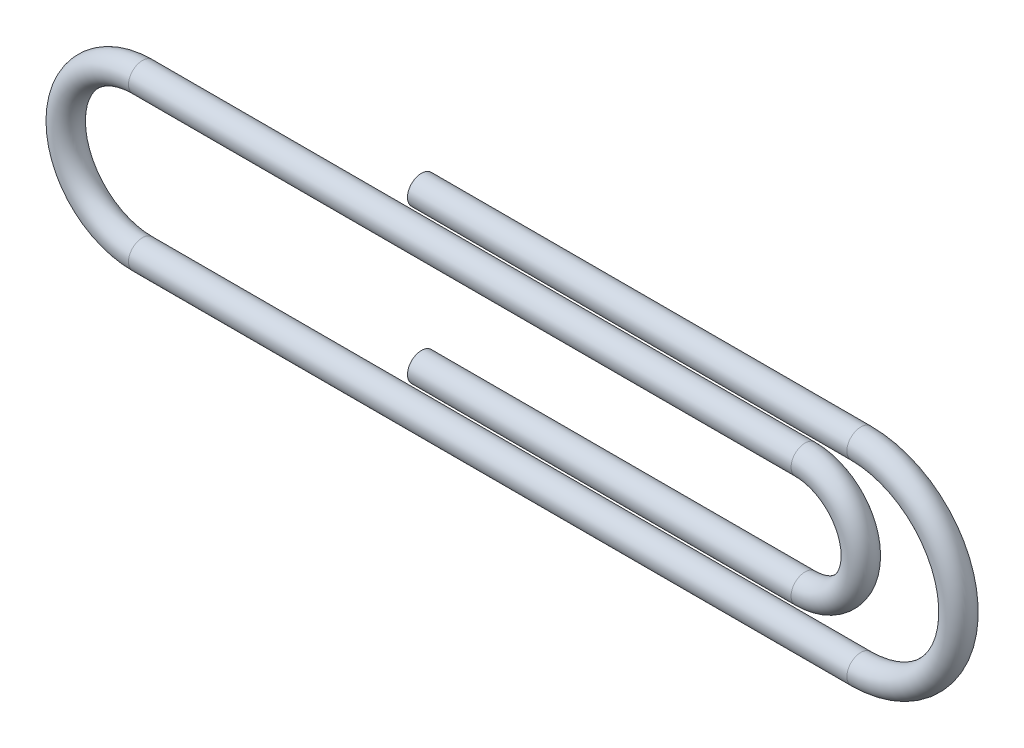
ISO-10303-21;
HEADER;
FILE_DESCRIPTION(('STEP AP214'),'2;1');
FILE_NAME('part.step','',(''),(''),'','','');
FILE_SCHEMA(('AUTOMOTIVE_DESIGN { 1 0 10303 214 1 1 1 1 }'));
ENDSEC;
DATA;
#1=APPLICATION_CONTEXT('core data for automotive mechanical design processes');
#2=APPLICATION_PROTOCOL_DEFINITION('international standard','automotive_design',2000,#1);
#3=PRODUCT_CONTEXT('',#1,'mechanical');
#4=PRODUCT('Part','Part','',(#3));
#5=PRODUCT_RELATED_PRODUCT_CATEGORY('part','',(#4));
#6=PRODUCT_DEFINITION_FORMATION('','',#4);
#7=PRODUCT_DEFINITION_CONTEXT('part definition',#1,'design');
#8=PRODUCT_DEFINITION('design','',#6,#7);
#9=PRODUCT_DEFINITION_SHAPE('','',#8);
#10=(LENGTH_UNIT() NAMED_UNIT(*) SI_UNIT(.MILLI.,.METRE.));
#11=(NAMED_UNIT(*) PLANE_ANGLE_UNIT() SI_UNIT($,.RADIAN.));
#12=(NAMED_UNIT(*) SI_UNIT($,.STERADIAN.) SOLID_ANGLE_UNIT());
#13=UNCERTAINTY_MEASURE_WITH_UNIT(LENGTH_MEASURE(1.E-05),#10,'distance_accuracy_value','');
#14=(GEOMETRIC_REPRESENTATION_CONTEXT(3) GLOBAL_UNCERTAINTY_ASSIGNED_CONTEXT((#13)) GLOBAL_UNIT_ASSIGNED_CONTEXT((#10,
#11,#12)) REPRESENTATION_CONTEXT('',''));
#15=CARTESIAN_POINT('',(0.,0.,0.));
#16=DIRECTION('',(0.,0.,1.));
#17=DIRECTION('',(1.,0.,0.));
#18=AXIS2_PLACEMENT_3D('',#15,#16,#17);
#19=CARTESIAN_POINT('',(0.,-2.,0.));
#20=DIRECTION('',(-1.,0.,0.));
#21=DIRECTION('',(0.,-1.,0.));
#22=AXIS2_PLACEMENT_3D('',#19,#20,#21);
#23=CYLINDRICAL_SURFACE('',#22,0.5);
#24=CARTESIAN_POINT('',(0.,-2.,0.));
#25=DIRECTION('',(-1.,0.,0.));
#26=DIRECTION('',(0.,0.,-1.));
#27=AXIS2_PLACEMENT_3D('',#24,#25,#26);
#28=CIRCLE('',#27,0.5);
#29=CARTESIAN_POINT('',(0.,-2.5,0.));
#30=VERTEX_POINT('',#29);
#31=EDGE_CURVE('E43',#30,#30,#28,.T.);
#32=ORIENTED_EDGE('',*,*,#31,.T.);
#33=EDGE_LOOP('',(#32));
#34=FACE_BOUND('',#33,.T.);
#35=CARTESIAN_POINT('',(-13.75,-2.,0.));
#36=DIRECTION('',(-1.,0.,0.));
#37=DIRECTION('',(0.,0.,-1.));
#38=AXIS2_PLACEMENT_3D('',#35,#36,#37);
#39=CIRCLE('',#38,0.5);
#40=CARTESIAN_POINT('',(-13.75,-2.,-0.5));
#41=VERTEX_POINT('',#40);
#42=EDGE_CURVE('E10',#41,#41,#39,.T.);
#43=ORIENTED_EDGE('',*,*,#42,.F.);
#44=EDGE_LOOP('',(#43));
#45=FACE_BOUND('',#44,.T.);
#46=ADVANCED_FACE('F40',(#34,#45),#23,.T.);
#47=CARTESIAN_POINT('',(0.,0.,0.));
#48=DIRECTION('',(0.,0.,-1.));
#49=DIRECTION('',(-1.,0.,0.));
#50=AXIS2_PLACEMENT_3D('',#47,#48,#49);
#51=TOROIDAL_SURFACE('',#50,2.,0.5);
#52=CARTESIAN_POINT('',(0.,2.,0.));
#53=DIRECTION('',(1.,0.,0.));
#54=DIRECTION('',(0.,0.,-1.));
#55=AXIS2_PLACEMENT_3D('',#52,#53,#54);
#56=CIRCLE('',#55,0.5);
#57=CARTESIAN_POINT('',(0.,2.5,0.));
#58=VERTEX_POINT('',#57);
#59=EDGE_CURVE('E50',#58,#58,#56,.T.);
#60=CARTESIAN_POINT('',(0.,0.,0.));
#61=DIRECTION('',(0.,0.,-1.));
#62=DIRECTION('',(-1.,0.,0.));
#63=AXIS2_PLACEMENT_3D('',#60,#61,#62);
#64=CIRCLE('',#63,2.5);
#65=EDGE_CURVE('',#58,#30,#64,.T.);
#66=ORIENTED_EDGE('',*,*,#59,.T.);
#67=ORIENTED_EDGE('',*,*,#31,.F.);
#68=ORIENTED_EDGE('',*,*,#65,.T.);
#69=ORIENTED_EDGE('',*,*,#65,.F.);
#70=EDGE_LOOP('',(#66,#68,#67,#69));
#71=FACE_BOUND('',#70,.T.);
#72=ADVANCED_FACE('F87',(#71),#51,.T.);
#73=CARTESIAN_POINT('',(-23.75,2.,0.));
#74=DIRECTION('',(1.,0.,0.));
#75=DIRECTION('',(0.,0.,-1.));
#76=AXIS2_PLACEMENT_3D('',#73,#74,#75);
#77=CYLINDRICAL_SURFACE('',#76,0.5);
#78=CARTESIAN_POINT('',(-23.75,2.,0.));
#79=DIRECTION('',(1.,0.,0.));
#80=DIRECTION('',(0.,0.,-1.));
#81=AXIS2_PLACEMENT_3D('',#78,#79,#80);
#82=CIRCLE('',#81,0.5);
#83=CARTESIAN_POINT('',(-23.75,2.5,0.));
#84=VERTEX_POINT('',#83);
#85=EDGE_CURVE('E51',#84,#84,#82,.T.);
#86=ORIENTED_EDGE('',*,*,#85,.T.);
#87=EDGE_LOOP('',(#86));
#88=FACE_BOUND('',#87,.T.);
#89=ORIENTED_EDGE('',*,*,#59,.F.);
#90=EDGE_LOOP('',(#89));
#91=FACE_BOUND('',#90,.T.);
#92=ADVANCED_FACE('F93',(#88,#91),#77,.T.);
#93=CARTESIAN_POINT('',(-23.75,-0.75,0.));
#94=DIRECTION('',(0.,0.,-1.));
#95=DIRECTION('',(-1.,0.,0.));
#96=AXIS2_PLACEMENT_3D('',#93,#94,#95);
#97=TOROIDAL_SURFACE('',#96,2.75,0.5);
#98=CARTESIAN_POINT('',(-23.75,-3.5,0.));
#99=DIRECTION('',(-1.,0.,0.));
#100=DIRECTION('',(0.,0.,-1.));
#101=AXIS2_PLACEMENT_3D('',#98,#99,#100);
#102=CIRCLE('',#101,0.5);
#103=CARTESIAN_POINT('',(-23.75,-4.,0.));
#104=VERTEX_POINT('',#103);
#105=EDGE_CURVE('E57',#104,#104,#102,.T.);
#106=CARTESIAN_POINT('',(-23.75,-0.75,0.));
#107=DIRECTION('',(0.,0.,-1.));
#108=DIRECTION('',(-1.,0.,0.));
#109=AXIS2_PLACEMENT_3D('',#106,#107,#108);
#110=CIRCLE('',#109,3.25);
#111=EDGE_CURVE('',#104,#84,#110,.T.);
#112=ORIENTED_EDGE('',*,*,#105,.T.);
#113=ORIENTED_EDGE('',*,*,#85,.F.);
#114=ORIENTED_EDGE('',*,*,#111,.T.);
#115=ORIENTED_EDGE('',*,*,#111,.F.);
#116=EDGE_LOOP('',(#112,#114,#113,#115));
#117=FACE_BOUND('',#116,.T.);
#118=ADVANCED_FACE('F100',(#117),#97,.T.);
#119=CARTESIAN_POINT('',(2.,-3.5,0.));
#120=DIRECTION('',(-1.,0.,0.));
#121=DIRECTION('',(0.,0.,1.));
#122=AXIS2_PLACEMENT_3D('',#119,#120,#121);
#123=CYLINDRICAL_SURFACE('',#122,0.5);
#124=CARTESIAN_POINT('',(2.,-3.5,0.));
#125=DIRECTION('',(-1.,0.,0.));
#126=DIRECTION('',(0.,0.,-1.));
#127=AXIS2_PLACEMENT_3D('',#124,#125,#126);
#128=CIRCLE('',#127,0.5);
#129=CARTESIAN_POINT('',(2.,-4.,0.));
#130=VERTEX_POINT('',#129);
#131=EDGE_CURVE('E56',#130,#130,#128,.T.);
#132=ORIENTED_EDGE('',*,*,#131,.T.);
#133=EDGE_LOOP('',(#132));
#134=FACE_BOUND('',#133,.T.);
#135=ORIENTED_EDGE('',*,*,#105,.F.);
#136=EDGE_LOOP('',(#135));
#137=FACE_BOUND('',#136,.T.);
#138=ADVANCED_FACE('F102',(#134,#137),#123,.T.);
#139=CARTESIAN_POINT('',(2.,0.,0.));
#140=DIRECTION('',(0.,0.,-1.));
#141=DIRECTION('',(-1.,0.,0.));
#142=AXIS2_PLACEMENT_3D('',#139,#140,#141);
#143=TOROIDAL_SURFACE('',#142,3.5,0.5);
#144=CARTESIAN_POINT('',(2.,3.5,0.));
#145=DIRECTION('',(1.,0.,0.));
#146=DIRECTION('',(0.,0.,-1.));
#147=AXIS2_PLACEMENT_3D('',#144,#145,#146);
#148=CIRCLE('',#147,0.5);
#149=CARTESIAN_POINT('',(2.,4.,0.));
#150=VERTEX_POINT('',#149);
#151=EDGE_CURVE('E61',#150,#150,#148,.T.);
#152=CARTESIAN_POINT('',(2.,0.,0.));
#153=DIRECTION('',(0.,0.,-1.));
#154=DIRECTION('',(-1.,0.,0.));
#155=AXIS2_PLACEMENT_3D('',#152,#153,#154);
#156=CIRCLE('',#155,4.);
#157=EDGE_CURVE('',#150,#130,#156,.T.);
#158=ORIENTED_EDGE('',*,*,#151,.T.);
#159=ORIENTED_EDGE('',*,*,#131,.F.);
#160=ORIENTED_EDGE('',*,*,#157,.T.);
#161=ORIENTED_EDGE('',*,*,#157,.F.);
#162=EDGE_LOOP('',(#158,#160,#159,#161));
#163=FACE_BOUND('',#162,.T.);
#164=ADVANCED_FACE('F69',(#163),#143,.T.);
#165=CARTESIAN_POINT('',(2.,3.5,0.));
#166=DIRECTION('',(-1.,0.,0.));
#167=DIRECTION('',(0.,0.,1.));
#168=AXIS2_PLACEMENT_3D('',#165,#166,#167);
#169=CYLINDRICAL_SURFACE('',#168,0.5);
#170=ORIENTED_EDGE('',*,*,#151,.F.);
#171=EDGE_LOOP('',(#170));
#172=FACE_BOUND('',#171,.T.);
#173=CARTESIAN_POINT('',(-13.75,3.5,0.));
#174=DIRECTION('',(1.,0.,0.));
#175=DIRECTION('',(0.,0.,-1.));
#176=AXIS2_PLACEMENT_3D('',#173,#174,#175);
#177=CIRCLE('',#176,0.5);
#178=CARTESIAN_POINT('',(-13.75,3.5,-0.5));
#179=VERTEX_POINT('',#178);
#180=EDGE_CURVE('E65',#179,#179,#177,.T.);
#181=ORIENTED_EDGE('',*,*,#180,.T.);
#182=EDGE_LOOP('',(#181));
#183=FACE_BOUND('',#182,.T.);
#184=ADVANCED_FACE('F75',(#172,#183),#169,.T.);
#185=CARTESIAN_POINT('',(-13.75,-2.,0.));
#186=DIRECTION('',(-1.,0.,0.));
#187=DIRECTION('',(0.,0.,-1.));
#188=AXIS2_PLACEMENT_3D('',#185,#186,#187);
#189=PLANE('',#188);
#190=ORIENTED_EDGE('',*,*,#42,.T.);
#191=EDGE_LOOP('',(#190));
#192=FACE_BOUND('',#191,.T.);
#193=ADVANCED_FACE('F73',(#192),#189,.T.);
#194=CARTESIAN_POINT('',(-13.75,3.5,0.));
#195=DIRECTION('',(1.,0.,0.));
#196=DIRECTION('',(0.,0.,-1.));
#197=AXIS2_PLACEMENT_3D('',#194,#195,#196);
#198=PLANE('',#197);
#199=ORIENTED_EDGE('',*,*,#180,.F.);
#200=EDGE_LOOP('',(#199));
#201=FACE_BOUND('',#200,.T.);
#202=ADVANCED_FACE('F76',(#201),#198,.F.);
#203=CLOSED_SHELL('',(#46,#72,#92,#118,#138,#164,#184,#193,#202));
#204=MANIFOLD_SOLID_BREP('B2',#203);
#205=ADVANCED_BREP_SHAPE_REPRESENTATION('',(#18,#204),#14);
#206=SHAPE_DEFINITION_REPRESENTATION(#9,#205);
ENDSEC;
END-ISO-10303-21;
